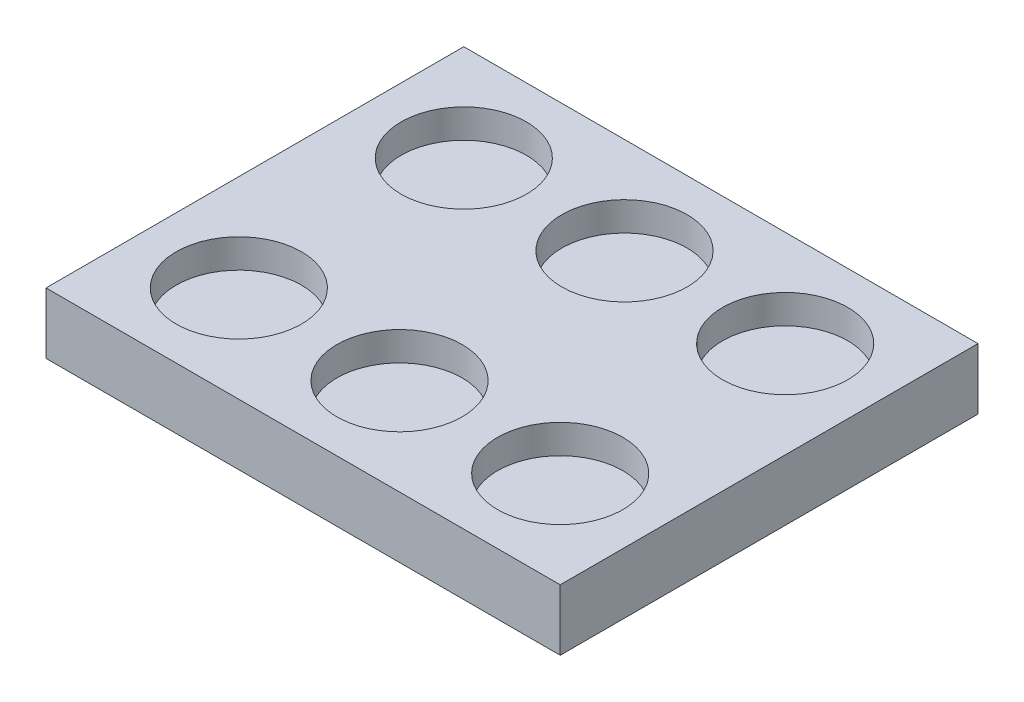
from build123d import *

# Parameters (mm, degrees)
SKETCH1_W           = 32
SKETCH1_H           = 26
SKETCH1_R           = 3.9
BOSS_EXTRUDE1_DEPTH = 1.8
SKETCH2_W           = 32
SKETCH2_H           = 26
BOSS_EXTRUDE2_DEPTH = 2


with BuildPart() as part:
    # Sketch1 → Boss-Extrude1 (new body)
    with BuildSketch(Plane(origin=(0, 0, 0), x_dir=(1, 0, 0), z_dir=(0, 1, 0))):
        with Locations((-1, 0)):
            Rectangle(SKETCH1_W, SKETCH1_H)
        with Locations(Location((-11, 7, 0), (0, 0, 270))):
            Circle(SKETCH1_R, mode=Mode.SUBTRACT)
        with Locations(Location((-1, 7, 0), (0, 0, 270))):
            Circle(SKETCH1_R, mode=Mode.SUBTRACT)
        with Locations(Location((9, 7, 0), (0, 0, 270))):
            Circle(SKETCH1_R, mode=Mode.SUBTRACT)
        with Locations(Location((-11, -7, 0), (0, 0, 90))):
            Circle(SKETCH1_R, mode=Mode.SUBTRACT)
        with Locations(Location((-1, -7, 0), (0, 0, 90))):
            Circle(SKETCH1_R, mode=Mode.SUBTRACT)
        with Locations(Location((9, -7, 0), (0, 0, 90))):
            Circle(SKETCH1_R, mode=Mode.SUBTRACT)
    extrude(amount=BOSS_EXTRUDE1_DEPTH)

    # Sketch2 → Boss-Extrude2 (add)
    with BuildSketch(Plane.XZ):
        with Locations((-1, 0)):
            Rectangle(SKETCH2_W, SKETCH2_H)
    extrude(amount=BOSS_EXTRUDE2_DEPTH)


solid = part.part
